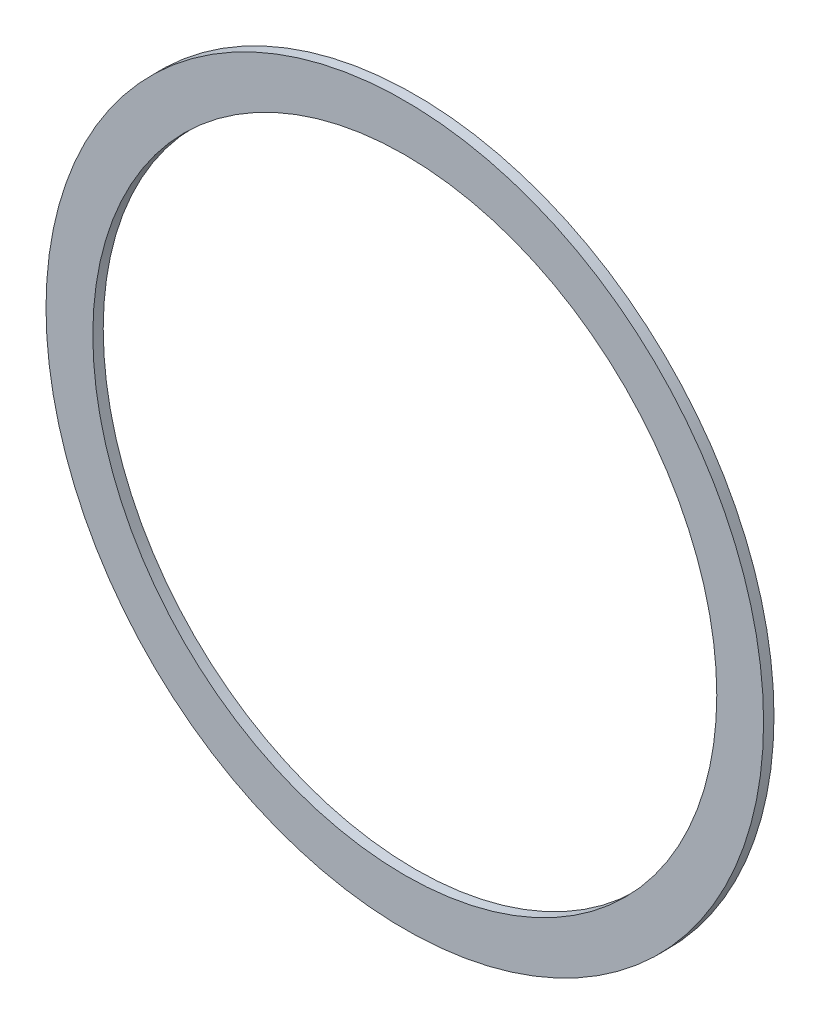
from build123d import *

# Parameters (mm, degrees)
SKETCH1_R           = 69
SKETCH1_R_2         = 60
BOSS_EXTRUDE1_DEPTH = 1


with BuildPart() as part:
    # Sketch1 → Boss-Extrude1 (new, symmetric)
    with BuildSketch(Plane.XY):
        Circle(SKETCH1_R)
        Circle(SKETCH1_R_2, mode=Mode.SUBTRACT)
    extrude(amount=BOSS_EXTRUDE1_DEPTH, both=True)


solid = part.part
